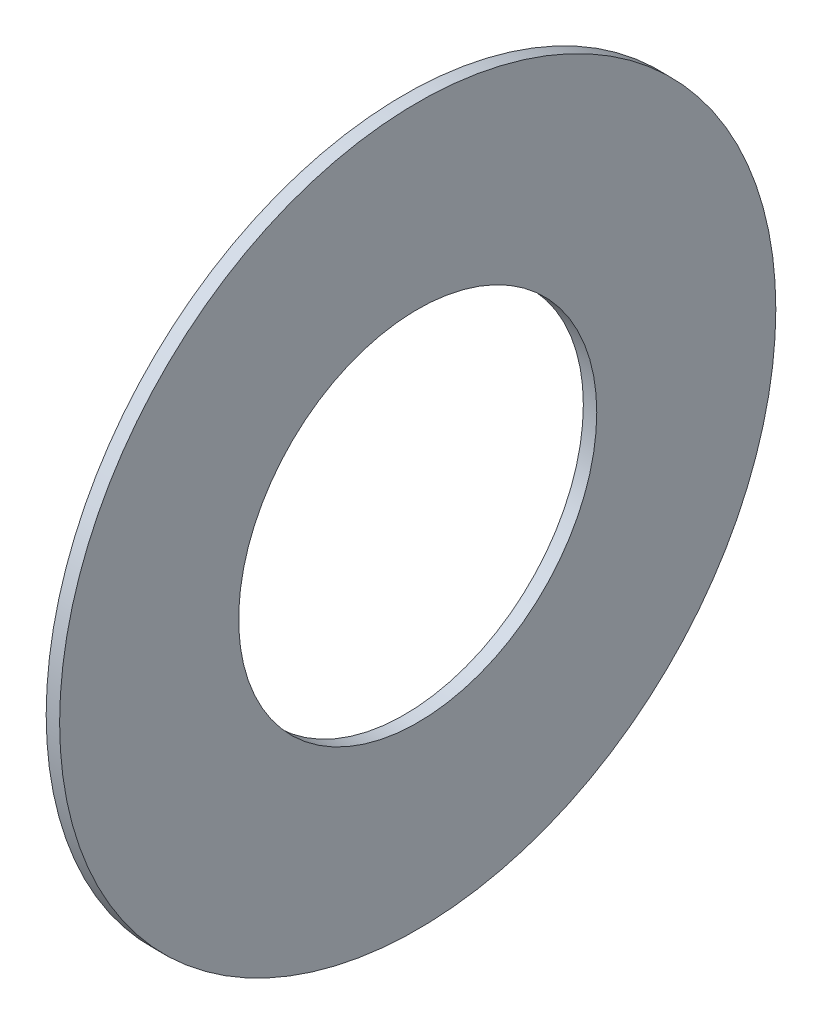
ISO-10303-21;
HEADER;
FILE_DESCRIPTION(('STEP AP214'),'2;1');
FILE_NAME('part.step','',(''),(''),'','','');
FILE_SCHEMA(('AUTOMOTIVE_DESIGN { 1 0 10303 214 1 1 1 1 }'));
ENDSEC;
DATA;
#1=APPLICATION_CONTEXT('core data for automotive mechanical design processes');
#2=APPLICATION_PROTOCOL_DEFINITION('international standard','automotive_design',2000,#1);
#3=PRODUCT_CONTEXT('',#1,'mechanical');
#4=PRODUCT('Part','Part','',(#3));
#5=PRODUCT_RELATED_PRODUCT_CATEGORY('part','',(#4));
#6=PRODUCT_DEFINITION_FORMATION('','',#4);
#7=PRODUCT_DEFINITION_CONTEXT('part definition',#1,'design');
#8=PRODUCT_DEFINITION('design','',#6,#7);
#9=PRODUCT_DEFINITION_SHAPE('','',#8);
#10=(LENGTH_UNIT() NAMED_UNIT(*) SI_UNIT(.MILLI.,.METRE.));
#11=(NAMED_UNIT(*) PLANE_ANGLE_UNIT() SI_UNIT($,.RADIAN.));
#12=(NAMED_UNIT(*) SI_UNIT($,.STERADIAN.) SOLID_ANGLE_UNIT());
#13=UNCERTAINTY_MEASURE_WITH_UNIT(LENGTH_MEASURE(1.E-05),#10,'distance_accuracy_value','');
#14=(GEOMETRIC_REPRESENTATION_CONTEXT(3) GLOBAL_UNCERTAINTY_ASSIGNED_CONTEXT((#13)) GLOBAL_UNIT_ASSIGNED_CONTEXT((#10,
#11,#12)) REPRESENTATION_CONTEXT('',''));
#15=CARTESIAN_POINT('',(0.,0.,0.));
#16=DIRECTION('',(0.,0.,1.));
#17=DIRECTION('',(1.,0.,0.));
#18=AXIS2_PLACEMENT_3D('',#15,#16,#17);
#19=CARTESIAN_POINT('',(0.15,0.,0.));
#20=DIRECTION('',(1.,0.,0.));
#21=DIRECTION('',(0.,0.,-1.));
#22=AXIS2_PLACEMENT_3D('',#19,#20,#21);
#23=PLANE('',#22);
#24=CARTESIAN_POINT('',(0.15,0.,0.));
#25=DIRECTION('',(1.,0.,0.));
#26=DIRECTION('',(0.,0.,-1.));
#27=AXIS2_PLACEMENT_3D('',#24,#25,#26);
#28=CIRCLE('',#27,4.);
#29=CARTESIAN_POINT('',(0.15,0.,-4.));
#30=VERTEX_POINT('',#29);
#31=EDGE_CURVE('E27',#30,#30,#28,.F.);
#32=ORIENTED_EDGE('',*,*,#31,.F.);
#33=EDGE_LOOP('',(#32));
#34=FACE_BOUND('',#33,.T.);
#35=CARTESIAN_POINT('',(0.15,0.,0.));
#36=DIRECTION('',(1.,0.,0.));
#37=DIRECTION('',(0.,0.,-1.));
#38=AXIS2_PLACEMENT_3D('',#35,#36,#37);
#39=CIRCLE('',#38,2.);
#40=CARTESIAN_POINT('',(0.15,0.,-2.));
#41=VERTEX_POINT('',#40);
#42=EDGE_CURVE('E18',#41,#41,#39,.F.);
#43=ORIENTED_EDGE('',*,*,#42,.T.);
#44=EDGE_LOOP('',(#43));
#45=FACE_BOUND('',#44,.T.);
#46=ADVANCED_FACE('F15',(#34,#45),#23,.T.);
#47=CARTESIAN_POINT('',(0.,0.,0.));
#48=DIRECTION('',(1.,0.,0.));
#49=DIRECTION('',(0.,0.,-1.));
#50=AXIS2_PLACEMENT_3D('',#47,#48,#49);
#51=CYLINDRICAL_SURFACE('',#50,2.);
#52=CARTESIAN_POINT('',(0.,0.,0.));
#53=DIRECTION('',(1.,0.,0.));
#54=DIRECTION('',(0.,0.,-1.));
#55=AXIS2_PLACEMENT_3D('',#52,#53,#54);
#56=CIRCLE('',#55,2.);
#57=CARTESIAN_POINT('',(0.,0.,-2.));
#58=VERTEX_POINT('',#57);
#59=EDGE_CURVE('E22',#58,#58,#56,.T.);
#60=ORIENTED_EDGE('',*,*,#59,.F.);
#61=EDGE_LOOP('',(#60));
#62=FACE_BOUND('',#61,.T.);
#63=ORIENTED_EDGE('',*,*,#42,.F.);
#64=EDGE_LOOP('',(#63));
#65=FACE_BOUND('',#64,.T.);
#66=ADVANCED_FACE('F36',(#62,#65),#51,.F.);
#67=CARTESIAN_POINT('',(0.,0.,0.));
#68=DIRECTION('',(1.,0.,0.));
#69=DIRECTION('',(0.,0.,-1.));
#70=AXIS2_PLACEMENT_3D('',#67,#68,#69);
#71=CYLINDRICAL_SURFACE('',#70,4.);
#72=CARTESIAN_POINT('',(0.,0.,0.));
#73=DIRECTION('',(1.,0.,0.));
#74=DIRECTION('',(0.,0.,-1.));
#75=AXIS2_PLACEMENT_3D('',#72,#73,#74);
#76=CIRCLE('',#75,4.);
#77=CARTESIAN_POINT('',(0.,0.,-4.));
#78=VERTEX_POINT('',#77);
#79=EDGE_CURVE('E10',#78,#78,#76,.F.);
#80=ORIENTED_EDGE('',*,*,#79,.F.);
#81=EDGE_LOOP('',(#80));
#82=FACE_BOUND('',#81,.T.);
#83=ORIENTED_EDGE('',*,*,#31,.T.);
#84=EDGE_LOOP('',(#83));
#85=FACE_BOUND('',#84,.T.);
#86=ADVANCED_FACE('F38',(#82,#85),#71,.T.);
#87=CARTESIAN_POINT('',(0.,0.,0.));
#88=DIRECTION('',(-1.,0.,0.));
#89=DIRECTION('',(0.,0.,1.));
#90=AXIS2_PLACEMENT_3D('',#87,#88,#89);
#91=PLANE('',#90);
#92=ORIENTED_EDGE('',*,*,#79,.T.);
#93=EDGE_LOOP('',(#92));
#94=FACE_BOUND('',#93,.T.);
#95=ORIENTED_EDGE('',*,*,#59,.T.);
#96=EDGE_LOOP('',(#95));
#97=FACE_BOUND('',#96,.T.);
#98=ADVANCED_FACE('F45',(#94,#97),#91,.T.);
#99=CLOSED_SHELL('',(#46,#66,#86,#98));
#100=MANIFOLD_SOLID_BREP('B1',#99);
#101=ADVANCED_BREP_SHAPE_REPRESENTATION('',(#18,#100),#14);
#102=SHAPE_DEFINITION_REPRESENTATION(#9,#101);
ENDSEC;
END-ISO-10303-21;
